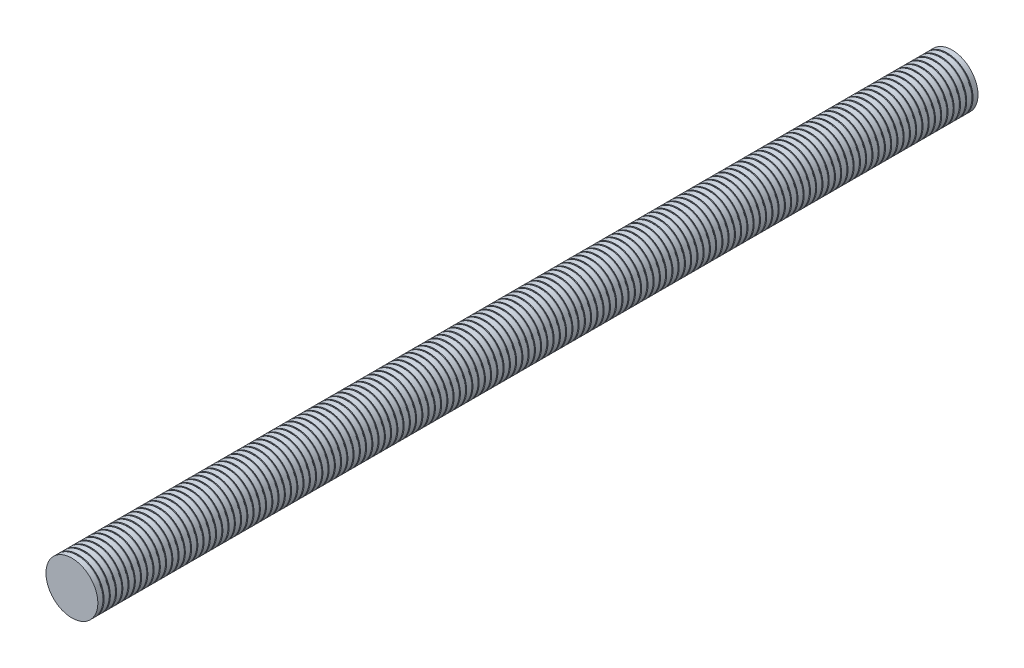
from build123d import *

# Parameters (mm, degrees)
SKETCH1_R           = 2
BOSS_EXTRUDE1_DEPTH = 70
SKETCH2_R           = 2.075495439
BOSS_EXTRUDE2_DEPTH = 0.4
LPATTERN1_COUNT     = 141
LPATTERN1_PITCH     = 0.5


with BuildPart() as part:
    # Sketch1 → Boss-Extrude1 (new body)
    with BuildSketch(Plane.XY):
        Circle(SKETCH1_R)
    extrude(amount=BOSS_EXTRUDE1_DEPTH)

    # Sketch2 → Boss-Extrude2 (add)
    with BuildSketch(Plane.XY.offset(70)):
        Circle(SKETCH2_R)
    boss_extrude2 = extrude(amount=BOSS_EXTRUDE2_DEPTH)

    # LPattern1: Boss-Extrude2 ×141
    with Locations(*[(0, 0, -i * LPATTERN1_PITCH) for i in range(1, LPATTERN1_COUNT)]):
        add(boss_extrude2)


solid = part.part
